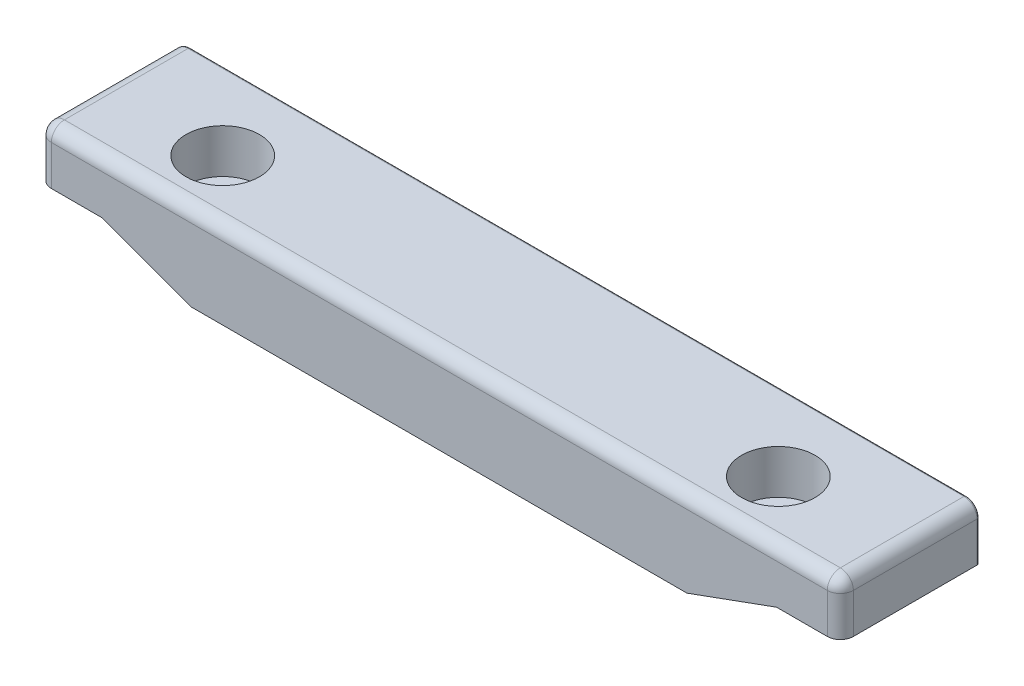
ISO-10303-21;
HEADER;
FILE_DESCRIPTION(('STEP AP214'),'2;1');
FILE_NAME('part.step','',(''),(''),'','','');
FILE_SCHEMA(('AUTOMOTIVE_DESIGN { 1 0 10303 214 1 1 1 1 }'));
ENDSEC;
DATA;
#1=APPLICATION_CONTEXT('core data for automotive mechanical design processes');
#2=APPLICATION_PROTOCOL_DEFINITION('international standard','automotive_design',2000,#1);
#3=PRODUCT_CONTEXT('',#1,'mechanical');
#4=PRODUCT('Part','Part','',(#3));
#5=PRODUCT_RELATED_PRODUCT_CATEGORY('part','',(#4));
#6=PRODUCT_DEFINITION_FORMATION('','',#4);
#7=PRODUCT_DEFINITION_CONTEXT('part definition',#1,'design');
#8=PRODUCT_DEFINITION('design','',#6,#7);
#9=PRODUCT_DEFINITION_SHAPE('','',#8);
#10=(LENGTH_UNIT() NAMED_UNIT(*) SI_UNIT(.MILLI.,.METRE.));
#11=(NAMED_UNIT(*) PLANE_ANGLE_UNIT() SI_UNIT($,.RADIAN.));
#12=(NAMED_UNIT(*) SI_UNIT($,.STERADIAN.) SOLID_ANGLE_UNIT());
#13=UNCERTAINTY_MEASURE_WITH_UNIT(LENGTH_MEASURE(1.E-05),#10,'distance_accuracy_value','');
#14=(GEOMETRIC_REPRESENTATION_CONTEXT(3) GLOBAL_UNCERTAINTY_ASSIGNED_CONTEXT((#13)) GLOBAL_UNIT_ASSIGNED_CONTEXT((#10,
#11,#12)) REPRESENTATION_CONTEXT('',''));
#15=CARTESIAN_POINT('',(0.,0.,0.));
#16=DIRECTION('',(0.,0.,1.));
#17=DIRECTION('',(1.,0.,0.));
#18=AXIS2_PLACEMENT_3D('',#15,#16,#17);
#19=CARTESIAN_POINT('',(-41.3365797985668,22.5093969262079,-17.05));
#20=DIRECTION('',(0.342020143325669,0.939692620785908,0.));
#21=DIRECTION('',(0.,0.,-1.));
#22=AXIS2_PLACEMENT_3D('',#19,#20,#21);
#23=PLANE('',#22);
#24=CARTESIAN_POINT('',(-36.8,20.8582169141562,-7.5));
#25=CARTESIAN_POINT('',(-36.8,20.8582169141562,-13.));
#26=CARTESIAN_POINT('',(-31.2999999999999,18.8563806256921,-13.));
#27=CARTESIAN_POINT('',(-31.3,18.8563806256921,-7.5));
#28=CARTESIAN_POINT('',(-31.2999999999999,18.8563806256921,-2.00000000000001));
#29=CARTESIAN_POINT('',(-36.8,20.8582169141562,-2.00000000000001));
#30=CARTESIAN_POINT('',(-36.8,20.8582169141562,-7.5));
#31=(BOUNDED_CURVE() B_SPLINE_CURVE(3,(#24,#25,#26,#27,#28,#29,#30),.UNSPECIFIED.,.T.,
.F.) B_SPLINE_CURVE_WITH_KNOTS((4,3,4),(0.,3.1415926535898,6.28318530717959),
.UNSPECIFIED.) CURVE() GEOMETRIC_REPRESENTATION_ITEM() RATIONAL_B_SPLINE_CURVE((1.,
0.333333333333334,0.333333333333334,1.,0.333333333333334,0.333333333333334,1.)) REPRESENTATION_ITEM(''));
#32=CARTESIAN_POINT('',(-36.8,20.8582169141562,-7.5));
#33=VERTEX_POINT('',#32);
#34=EDGE_CURVE('E208',#33,#33,#31,.T.);
#35=ORIENTED_EDGE('',*,*,#34,.F.);
#36=EDGE_LOOP('',(#35));
#37=FACE_BOUND('',#36,.T.);
#38=DIRECTION('',(-0.939692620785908,0.342020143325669,0.));
#39=VECTOR('',#38,1.);
#40=CARTESIAN_POINT('',(-41.3365797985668,22.5093969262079,0.));
#41=LINE('',#40,#39);
#42=CARTESIAN_POINT('',(-30.3483270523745,18.51,0.));
#43=VERTEX_POINT('',#42);
#44=CARTESIAN_POINT('',(-41.338236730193,22.51,0.));
#45=VERTEX_POINT('',#44);
#46=EDGE_CURVE('E215',#43,#45,#41,.T.);
#47=ORIENTED_EDGE('',*,*,#46,.T.);
#48=DIRECTION('',(0.,0.,1.));
#49=VECTOR('',#48,1.);
#50=CARTESIAN_POINT('',(-41.338236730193,22.51,-17.05));
#51=LINE('',#50,#49);
#52=CARTESIAN_POINT('',(-41.338236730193,22.51,-17.05));
#53=VERTEX_POINT('',#52);
#54=EDGE_CURVE('E387',#53,#45,#51,.T.);
#55=ORIENTED_EDGE('',*,*,#54,.F.);
#56=DIRECTION('',(-0.939692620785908,0.342020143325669,0.));
#57=VECTOR('',#56,1.);
#58=CARTESIAN_POINT('',(-41.3365797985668,22.5093969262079,-17.05));
#59=LINE('',#58,#57);
#60=CARTESIAN_POINT('',(-30.3483270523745,18.51,-17.05));
#61=VERTEX_POINT('',#60);
#62=EDGE_CURVE('E307',#61,#53,#59,.T.);
#63=ORIENTED_EDGE('',*,*,#62,.F.);
#64=DIRECTION('',(0.,0.,1.));
#65=VECTOR('',#64,1.);
#66=CARTESIAN_POINT('',(-30.3483270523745,18.51,-17.05));
#67=LINE('',#66,#65);
#68=EDGE_CURVE('E11',#61,#43,#67,.T.);
#69=ORIENTED_EDGE('',*,*,#68,.T.);
#70=EDGE_LOOP('',(#47,#55,#63,#69));
#71=FACE_BOUND('',#70,.T.);
#72=ADVANCED_FACE('F16',(#37,#71),#23,.F.);
#73=CARTESIAN_POINT('',(-30.3500903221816,18.51,-17.05));
#74=DIRECTION('',(0.,1.,0.));
#75=DIRECTION('',(1.,0.,0.));
#76=AXIS2_PLACEMENT_3D('',#73,#74,#75);
#77=PLANE('',#76);
#78=DIRECTION('',(-1.,0.,0.));
#79=VECTOR('',#78,1.);
#80=CARTESIAN_POINT('',(-30.3500903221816,18.51,0.));
#81=LINE('',#80,#79);
#82=CARTESIAN_POINT('',(30.3483270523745,18.51,0.));
#83=VERTEX_POINT('',#82);
#84=EDGE_CURVE('E222',#83,#43,#81,.T.);
#85=ORIENTED_EDGE('',*,*,#84,.T.);
#86=ORIENTED_EDGE('',*,*,#68,.F.);
#87=DIRECTION('',(-1.,0.,0.));
#88=VECTOR('',#87,1.);
#89=CARTESIAN_POINT('',(-30.3500903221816,18.51,-17.05));
#90=LINE('',#89,#88);
#91=CARTESIAN_POINT('',(30.3483270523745,18.51,-17.05));
#92=VERTEX_POINT('',#91);
#93=EDGE_CURVE('E238',#92,#61,#90,.T.);
#94=ORIENTED_EDGE('',*,*,#93,.F.);
#95=DIRECTION('',(0.,0.,1.));
#96=VECTOR('',#95,1.);
#97=CARTESIAN_POINT('',(30.3483270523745,18.51,-17.05));
#98=LINE('',#97,#96);
#99=EDGE_CURVE('E19',#92,#83,#98,.T.);
#100=ORIENTED_EDGE('',*,*,#99,.T.);
#101=EDGE_LOOP('',(#85,#86,#94,#100));
#102=FACE_BOUND('',#101,.T.);
#103=ADVANCED_FACE('F399',(#102),#77,.F.);
#104=CARTESIAN_POINT('',(41.3365797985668,22.5093969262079,-17.05));
#105=DIRECTION('',(-0.34202014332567,0.939692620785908,0.));
#106=DIRECTION('',(0.,0.,1.));
#107=AXIS2_PLACEMENT_3D('',#104,#105,#106);
#108=PLANE('',#107);
#109=CARTESIAN_POINT('',(36.8,20.8582169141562,-7.5));
#110=CARTESIAN_POINT('',(36.8,20.8582169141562,-2.00000000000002));
#111=CARTESIAN_POINT('',(31.3,18.8563806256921,-2.00000000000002));
#112=CARTESIAN_POINT('',(31.3,18.8563806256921,-7.5));
#113=CARTESIAN_POINT('',(31.3,18.8563806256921,-13.));
#114=CARTESIAN_POINT('',(36.8,20.8582169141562,-13.));
#115=CARTESIAN_POINT('',(36.8,20.8582169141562,-7.5));
#116=(BOUNDED_CURVE() B_SPLINE_CURVE(3,(#109,#110,#111,#112,#113,#114,#115),.UNSPECIFIED.,.T.,
.F.) B_SPLINE_CURVE_WITH_KNOTS((4,3,4),(0.,3.1415926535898,6.28318530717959),
.UNSPECIFIED.) CURVE() GEOMETRIC_REPRESENTATION_ITEM() RATIONAL_B_SPLINE_CURVE((1.,
0.333333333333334,0.333333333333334,1.,0.333333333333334,0.333333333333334,1.)) REPRESENTATION_ITEM(''));
#117=CARTESIAN_POINT('',(36.8,20.8582169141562,-7.5));
#118=VERTEX_POINT('',#117);
#119=EDGE_CURVE('E228',#118,#118,#116,.T.);
#120=ORIENTED_EDGE('',*,*,#119,.F.);
#121=EDGE_LOOP('',(#120));
#122=FACE_BOUND('',#121,.T.);
#123=DIRECTION('',(-0.939692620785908,-0.34202014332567,0.));
#124=VECTOR('',#123,1.);
#125=CARTESIAN_POINT('',(41.3365797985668,22.5093969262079,0.));
#126=LINE('',#125,#124);
#127=CARTESIAN_POINT('',(41.338236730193,22.51,0.));
#128=VERTEX_POINT('',#127);
#129=EDGE_CURVE('E205',#128,#83,#126,.T.);
#130=ORIENTED_EDGE('',*,*,#129,.T.);
#131=ORIENTED_EDGE('',*,*,#99,.F.);
#132=DIRECTION('',(-0.939692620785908,-0.34202014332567,0.));
#133=VECTOR('',#132,1.);
#134=CARTESIAN_POINT('',(41.3365797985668,22.5093969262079,-17.05));
#135=LINE('',#134,#133);
#136=CARTESIAN_POINT('',(41.338236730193,22.51,-17.05));
#137=VERTEX_POINT('',#136);
#138=EDGE_CURVE('E337',#137,#92,#135,.T.);
#139=ORIENTED_EDGE('',*,*,#138,.F.);
#140=DIRECTION('',(0.,0.,1.));
#141=VECTOR('',#140,1.);
#142=CARTESIAN_POINT('',(41.338236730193,22.51,-17.05));
#143=LINE('',#142,#141);
#144=EDGE_CURVE('E389',#137,#128,#143,.T.);
#145=ORIENTED_EDGE('',*,*,#144,.T.);
#146=EDGE_LOOP('',(#130,#131,#139,#145));
#147=FACE_BOUND('',#146,.T.);
#148=ADVANCED_FACE('F402',(#122,#147),#108,.F.);
#149=CARTESIAN_POINT('',(49.15,22.51,-17.05));
#150=DIRECTION('',(0.,1.,0.));
#151=DIRECTION('',(1.,0.,0.));
#152=AXIS2_PLACEMENT_3D('',#149,#150,#151);
#153=PLANE('',#152);
#154=CARTESIAN_POINT('',(47.55,22.51,-1.6));
#155=DIRECTION('',(0.,-1.,0.));
#156=DIRECTION('',(-1.,0.,0.));
#157=AXIS2_PLACEMENT_3D('',#154,#155,#156);
#158=CIRCLE('',#157,1.6);
#159=CARTESIAN_POINT('',(49.15,22.51,-1.6));
#160=VERTEX_POINT('',#159);
#161=CARTESIAN_POINT('',(47.55,22.51,0.));
#162=VERTEX_POINT('',#161);
#163=EDGE_CURVE('E170',#160,#162,#158,.T.);
#164=ORIENTED_EDGE('',*,*,#163,.T.);
#165=DIRECTION('',(-1.,0.,0.));
#166=VECTOR('',#165,1.);
#167=CARTESIAN_POINT('',(49.15,22.51,0.));
#168=LINE('',#167,#166);
#169=EDGE_CURVE('E199',#162,#128,#168,.T.);
#170=ORIENTED_EDGE('',*,*,#169,.T.);
#171=ORIENTED_EDGE('',*,*,#144,.F.);
#172=DIRECTION('',(-1.,0.,0.));
#173=VECTOR('',#172,1.);
#174=CARTESIAN_POINT('',(49.15,22.51,-17.05));
#175=LINE('',#174,#173);
#176=CARTESIAN_POINT('',(48.85,22.51,-17.05));
#177=VERTEX_POINT('',#176);
#178=EDGE_CURVE('E333',#177,#137,#175,.T.);
#179=ORIENTED_EDGE('',*,*,#178,.F.);
#180=CARTESIAN_POINT('',(48.85,22.51,-16.75));
#181=DIRECTION('',(0.,-1.,0.));
#182=DIRECTION('',(-1.,0.,0.));
#183=AXIS2_PLACEMENT_3D('',#180,#181,#182);
#184=CIRCLE('',#183,0.3);
#185=CARTESIAN_POINT('',(49.15,22.51,-16.75));
#186=VERTEX_POINT('',#185);
#187=EDGE_CURVE('E376',#177,#186,#184,.T.);
#188=ORIENTED_EDGE('',*,*,#187,.T.);
#189=DIRECTION('',(0.,0.,1.));
#190=VECTOR('',#189,1.);
#191=CARTESIAN_POINT('',(49.15,22.51,-17.05));
#192=LINE('',#191,#190);
#193=EDGE_CURVE('E213',#186,#160,#192,.T.);
#194=ORIENTED_EDGE('',*,*,#193,.T.);
#195=EDGE_LOOP('',(#164,#170,#171,#179,#188,#194));
#196=FACE_BOUND('',#195,.T.);
#197=ADVANCED_FACE('F411',(#196),#153,.F.);
#198=CARTESIAN_POINT('',(-49.15,22.51,-17.05));
#199=DIRECTION('',(0.,1.,0.));
#200=DIRECTION('',(1.,0.,0.));
#201=AXIS2_PLACEMENT_3D('',#198,#199,#200);
#202=PLANE('',#201);
#203=CARTESIAN_POINT('',(-47.55,22.51,-1.6));
#204=DIRECTION('',(0.,-1.,0.));
#205=DIRECTION('',(0.,0.,1.));
#206=AXIS2_PLACEMENT_3D('',#203,#204,#205);
#207=CIRCLE('',#206,1.6);
#208=CARTESIAN_POINT('',(-47.55,22.51,0.));
#209=VERTEX_POINT('',#208);
#210=CARTESIAN_POINT('',(-49.15,22.51,-1.6));
#211=VERTEX_POINT('',#210);
#212=EDGE_CURVE('E182',#209,#211,#207,.T.);
#213=ORIENTED_EDGE('',*,*,#212,.T.);
#214=DIRECTION('',(0.,0.,1.));
#215=VECTOR('',#214,1.);
#216=CARTESIAN_POINT('',(-49.15,22.51,-17.05));
#217=LINE('',#216,#215);
#218=CARTESIAN_POINT('',(-49.15,22.51,-16.75));
#219=VERTEX_POINT('',#218);
#220=EDGE_CURVE('E280',#219,#211,#217,.T.);
#221=ORIENTED_EDGE('',*,*,#220,.F.);
#222=CARTESIAN_POINT('',(-48.85,22.51,-16.75));
#223=DIRECTION('',(0.,-1.,0.));
#224=DIRECTION('',(0.,0.,1.));
#225=AXIS2_PLACEMENT_3D('',#222,#223,#224);
#226=CIRCLE('',#225,0.3);
#227=CARTESIAN_POINT('',(-48.85,22.51,-17.05));
#228=VERTEX_POINT('',#227);
#229=EDGE_CURVE('E316',#219,#228,#226,.T.);
#230=ORIENTED_EDGE('',*,*,#229,.T.);
#231=DIRECTION('',(-1.,0.,0.));
#232=VECTOR('',#231,1.);
#233=CARTESIAN_POINT('',(-49.15,22.51,-17.05));
#234=LINE('',#233,#232);
#235=EDGE_CURVE('E311',#53,#228,#234,.T.);
#236=ORIENTED_EDGE('',*,*,#235,.F.);
#237=ORIENTED_EDGE('',*,*,#54,.T.);
#238=DIRECTION('',(-1.,0.,0.));
#239=VECTOR('',#238,1.);
#240=CARTESIAN_POINT('',(-49.15,22.51,0.));
#241=LINE('',#240,#239);
#242=EDGE_CURVE('E223',#45,#209,#241,.T.);
#243=ORIENTED_EDGE('',*,*,#242,.T.);
#244=EDGE_LOOP('',(#213,#221,#230,#236,#237,#243));
#245=FACE_BOUND('',#244,.T.);
#246=ADVANCED_FACE('F464',(#245),#202,.F.);
#247=CARTESIAN_POINT('',(-34.05,29.,-7.5));
#248=DIRECTION('',(0.,1.,0.));
#249=DIRECTION('',(0.,0.,1.));
#250=AXIS2_PLACEMENT_3D('',#247,#248,#249);
#251=CYLINDRICAL_SURFACE('',#250,4.5);
#252=CARTESIAN_POINT('',(-34.05,23.6,-7.5));
#253=DIRECTION('',(0.,1.,0.));
#254=DIRECTION('',(0.,0.,1.));
#255=AXIS2_PLACEMENT_3D('',#252,#253,#254);
#256=CIRCLE('',#255,4.5);
#257=CARTESIAN_POINT('',(-34.05,23.6,-3.));
#258=VERTEX_POINT('',#257);
#259=EDGE_CURVE('E34',#258,#258,#256,.T.);
#260=ORIENTED_EDGE('',*,*,#259,.F.);
#261=EDGE_LOOP('',(#260));
#262=FACE_BOUND('',#261,.T.);
#263=CARTESIAN_POINT('',(-34.05,29.,-7.5));
#264=DIRECTION('',(0.,1.,0.));
#265=DIRECTION('',(0.,0.,1.));
#266=AXIS2_PLACEMENT_3D('',#263,#264,#265);
#267=CIRCLE('',#266,4.5);
#268=CARTESIAN_POINT('',(-34.05,29.,-3.));
#269=VERTEX_POINT('',#268);
#270=EDGE_CURVE('E301',#269,#269,#267,.T.);
#271=ORIENTED_EDGE('',*,*,#270,.T.);
#272=EDGE_LOOP('',(#271));
#273=FACE_BOUND('',#272,.T.);
#274=ADVANCED_FACE('F501',(#262,#273),#251,.F.);
#275=CARTESIAN_POINT('',(-31.3,23.6,-7.5));
#276=DIRECTION('',(0.,-1.,0.));
#277=DIRECTION('',(0.,0.,-1.));
#278=AXIS2_PLACEMENT_3D('',#275,#276,#277);
#279=PLANE('',#278);
#280=CARTESIAN_POINT('',(-34.05,23.6,-7.5));
#281=DIRECTION('',(0.,1.,0.));
#282=DIRECTION('',(0.,0.,1.));
#283=AXIS2_PLACEMENT_3D('',#280,#281,#282);
#284=CIRCLE('',#283,2.75);
#285=CARTESIAN_POINT('',(-34.05,23.6,-4.75));
#286=VERTEX_POINT('',#285);
#287=EDGE_CURVE('E214',#286,#286,#284,.T.);
#288=ORIENTED_EDGE('',*,*,#287,.F.);
#289=EDGE_LOOP('',(#288));
#290=FACE_BOUND('',#289,.T.);
#291=ORIENTED_EDGE('',*,*,#259,.T.);
#292=EDGE_LOOP('',(#291));
#293=FACE_BOUND('',#292,.T.);
#294=ADVANCED_FACE('F512',(#290,#293),#279,.F.);
#295=CARTESIAN_POINT('',(34.05,29.,-7.5));
#296=DIRECTION('',(0.,1.,0.));
#297=DIRECTION('',(0.,0.,1.));
#298=AXIS2_PLACEMENT_3D('',#295,#296,#297);
#299=CYLINDRICAL_SURFACE('',#298,4.5);
#300=CARTESIAN_POINT('',(34.05,23.6,-7.5));
#301=DIRECTION('',(0.,1.,0.));
#302=DIRECTION('',(0.,0.,1.));
#303=AXIS2_PLACEMENT_3D('',#300,#301,#302);
#304=CIRCLE('',#303,4.5);
#305=CARTESIAN_POINT('',(34.05,23.6,-3.));
#306=VERTEX_POINT('',#305);
#307=EDGE_CURVE('E44',#306,#306,#304,.T.);
#308=ORIENTED_EDGE('',*,*,#307,.F.);
#309=EDGE_LOOP('',(#308));
#310=FACE_BOUND('',#309,.T.);
#311=CARTESIAN_POINT('',(34.05,29.,-7.5));
#312=DIRECTION('',(0.,1.,0.));
#313=DIRECTION('',(0.,0.,1.));
#314=AXIS2_PLACEMENT_3D('',#311,#312,#313);
#315=CIRCLE('',#314,4.5);
#316=CARTESIAN_POINT('',(34.05,29.,-3.));
#317=VERTEX_POINT('',#316);
#318=EDGE_CURVE('E304',#317,#317,#315,.T.);
#319=ORIENTED_EDGE('',*,*,#318,.T.);
#320=EDGE_LOOP('',(#319));
#321=FACE_BOUND('',#320,.T.);
#322=ADVANCED_FACE('F522',(#310,#321),#299,.F.);
#323=CARTESIAN_POINT('',(36.8,23.6,-7.5));
#324=DIRECTION('',(0.,-1.,0.));
#325=DIRECTION('',(0.,0.,-1.));
#326=AXIS2_PLACEMENT_3D('',#323,#324,#325);
#327=PLANE('',#326);
#328=CARTESIAN_POINT('',(34.05,23.6,-7.5));
#329=DIRECTION('',(0.,1.,0.));
#330=DIRECTION('',(0.,0.,1.));
#331=AXIS2_PLACEMENT_3D('',#328,#329,#330);
#332=CIRCLE('',#331,2.75);
#333=CARTESIAN_POINT('',(34.05,23.6,-4.75));
#334=VERTEX_POINT('',#333);
#335=EDGE_CURVE('E224',#334,#334,#332,.T.);
#336=ORIENTED_EDGE('',*,*,#335,.F.);
#337=EDGE_LOOP('',(#336));
#338=FACE_BOUND('',#337,.T.);
#339=ORIENTED_EDGE('',*,*,#307,.T.);
#340=EDGE_LOOP('',(#339));
#341=FACE_BOUND('',#340,.T.);
#342=ADVANCED_FACE('F533',(#338,#341),#327,.F.);
#343=CARTESIAN_POINT('',(47.55,27.4,-16.75));
#344=DIRECTION('',(0.,0.,1.));
#345=DIRECTION('',(1.,0.,0.));
#346=AXIS2_PLACEMENT_3D('',#343,#344,#345);
#347=TOROIDAL_SURFACE('',#346,1.3,0.3);
#348=CARTESIAN_POINT('',(47.55,28.7,-16.75));
#349=DIRECTION('',(1.,0.,0.));
#350=DIRECTION('',(0.,0.,-1.));
#351=AXIS2_PLACEMENT_3D('',#348,#349,#350);
#352=CIRCLE('',#351,0.3);
#353=CARTESIAN_POINT('',(47.55,28.7,-17.05));
#354=VERTEX_POINT('',#353);
#355=CARTESIAN_POINT('',(47.55,29.,-16.75));
#356=VERTEX_POINT('',#355);
#357=EDGE_CURVE('E372',#354,#356,#352,.T.);
#358=ORIENTED_EDGE('',*,*,#357,.T.);
#359=CARTESIAN_POINT('',(47.55,27.4,-16.75));
#360=DIRECTION('',(0.,0.,1.));
#361=DIRECTION('',(1.,0.,0.));
#362=AXIS2_PLACEMENT_3D('',#359,#360,#361);
#363=CIRCLE('',#362,1.6);
#364=CARTESIAN_POINT('',(49.15,27.4,-16.75));
#365=VERTEX_POINT('',#364);
#366=EDGE_CURVE('E181',#365,#356,#363,.T.);
#367=ORIENTED_EDGE('',*,*,#366,.F.);
#368=CARTESIAN_POINT('',(48.85,27.4,-16.75));
#369=DIRECTION('',(0.,1.,0.));
#370=DIRECTION('',(0.,0.,1.));
#371=AXIS2_PLACEMENT_3D('',#368,#369,#370);
#372=CIRCLE('',#371,0.3);
#373=CARTESIAN_POINT('',(48.85,27.4,-17.05));
#374=VERTEX_POINT('',#373);
#375=EDGE_CURVE('E380',#365,#374,#372,.T.);
#376=ORIENTED_EDGE('',*,*,#375,.T.);
#377=CARTESIAN_POINT('',(47.55,27.4,-17.05));
#378=DIRECTION('',(0.,0.,-1.));
#379=DIRECTION('',(1.,0.,0.));
#380=AXIS2_PLACEMENT_3D('',#377,#378,#379);
#381=CIRCLE('',#380,1.3);
#382=EDGE_CURVE('E259',#354,#374,#381,.T.);
#383=ORIENTED_EDGE('',*,*,#382,.F.);
#384=EDGE_LOOP('',(#358,#367,#376,#383));
#385=FACE_BOUND('',#384,.T.);
#386=ADVANCED_FACE('F544',(#385),#347,.T.);
#387=CARTESIAN_POINT('',(48.85,29.,-16.75));
#388=DIRECTION('',(0.,-1.,0.));
#389=DIRECTION('',(1.,0.,0.));
#390=AXIS2_PLACEMENT_3D('',#387,#388,#389);
#391=CYLINDRICAL_SURFACE('',#390,0.3);
#392=ORIENTED_EDGE('',*,*,#187,.F.);
#393=DIRECTION('',(0.,-1.,0.));
#394=VECTOR('',#393,1.);
#395=CARTESIAN_POINT('',(48.85,-27.4,-17.05));
#396=LINE('',#395,#394);
#397=EDGE_CURVE('E329',#374,#177,#396,.T.);
#398=ORIENTED_EDGE('',*,*,#397,.F.);
#399=ORIENTED_EDGE('',*,*,#375,.F.);
#400=DIRECTION('',(0.,1.,0.));
#401=VECTOR('',#400,1.);
#402=CARTESIAN_POINT('',(49.15,27.4,-16.75));
#403=LINE('',#402,#401);
#404=EDGE_CURVE('E244',#186,#365,#403,.T.);
#405=ORIENTED_EDGE('',*,*,#404,.F.);
#406=EDGE_LOOP('',(#392,#398,#399,#405));
#407=FACE_BOUND('',#406,.T.);
#408=ADVANCED_FACE('F555',(#407),#391,.T.);
#409=CARTESIAN_POINT('',(-49.15,28.7,-16.75));
#410=DIRECTION('',(1.,0.,0.));
#411=DIRECTION('',(0.,0.,-1.));
#412=AXIS2_PLACEMENT_3D('',#409,#410,#411);
#413=CYLINDRICAL_SURFACE('',#412,0.3);
#414=CARTESIAN_POINT('',(-47.55,28.7,-16.75));
#415=DIRECTION('',(1.,0.,0.));
#416=DIRECTION('',(0.,0.,-1.));
#417=AXIS2_PLACEMENT_3D('',#414,#415,#416);
#418=CIRCLE('',#417,0.3);
#419=CARTESIAN_POINT('',(-47.55,28.7,-17.05));
#420=VERTEX_POINT('',#419);
#421=CARTESIAN_POINT('',(-47.55,29.,-16.75));
#422=VERTEX_POINT('',#421);
#423=EDGE_CURVE('E368',#420,#422,#418,.T.);
#424=ORIENTED_EDGE('',*,*,#423,.T.);
#425=DIRECTION('',(-1.,0.,0.));
#426=VECTOR('',#425,1.);
#427=CARTESIAN_POINT('',(-47.55,29.,-16.75));
#428=LINE('',#427,#426);
#429=EDGE_CURVE('E264',#356,#422,#428,.T.);
#430=ORIENTED_EDGE('',*,*,#429,.F.);
#431=ORIENTED_EDGE('',*,*,#357,.F.);
#432=DIRECTION('',(1.,0.,0.));
#433=VECTOR('',#432,1.);
#434=CARTESIAN_POINT('',(47.55,28.7,-17.05));
#435=LINE('',#434,#433);
#436=EDGE_CURVE('E255',#420,#354,#435,.T.);
#437=ORIENTED_EDGE('',*,*,#436,.F.);
#438=EDGE_LOOP('',(#424,#430,#431,#437));
#439=FACE_BOUND('',#438,.T.);
#440=ADVANCED_FACE('F566',(#439),#413,.T.);
#441=CARTESIAN_POINT('',(-47.55,27.4,-16.75));
#442=DIRECTION('',(0.,0.,1.));
#443=DIRECTION('',(1.,0.,0.));
#444=AXIS2_PLACEMENT_3D('',#441,#442,#443);
#445=TOROIDAL_SURFACE('',#444,1.3,0.3);
#446=CARTESIAN_POINT('',(-48.85,27.4,-16.75));
#447=DIRECTION('',(0.,1.,0.));
#448=DIRECTION('',(0.,0.,1.));
#449=AXIS2_PLACEMENT_3D('',#446,#447,#448);
#450=CIRCLE('',#449,0.3);
#451=CARTESIAN_POINT('',(-48.85,27.4,-17.05));
#452=VERTEX_POINT('',#451);
#453=CARTESIAN_POINT('',(-49.15,27.4,-16.75));
#454=VERTEX_POINT('',#453);
#455=EDGE_CURVE('E319',#452,#454,#450,.T.);
#456=ORIENTED_EDGE('',*,*,#455,.T.);
#457=CARTESIAN_POINT('',(-47.55,27.4,-16.75));
#458=DIRECTION('',(0.,0.,1.));
#459=DIRECTION('',(1.,0.,0.));
#460=AXIS2_PLACEMENT_3D('',#457,#458,#459);
#461=CIRCLE('',#460,1.6);
#462=EDGE_CURVE('E352',#422,#454,#461,.T.);
#463=ORIENTED_EDGE('',*,*,#462,.F.);
#464=ORIENTED_EDGE('',*,*,#423,.F.);
#465=CARTESIAN_POINT('',(-47.55,27.4,-17.05));
#466=DIRECTION('',(0.,0.,-1.));
#467=DIRECTION('',(1.,0.,0.));
#468=AXIS2_PLACEMENT_3D('',#465,#466,#467);
#469=CIRCLE('',#468,1.3);
#470=EDGE_CURVE('E260',#452,#420,#469,.T.);
#471=ORIENTED_EDGE('',*,*,#470,.F.);
#472=EDGE_LOOP('',(#456,#463,#464,#471));
#473=FACE_BOUND('',#472,.T.);
#474=ADVANCED_FACE('F576',(#473),#445,.T.);
#475=CARTESIAN_POINT('',(-48.85,29.,-16.75));
#476=DIRECTION('',(0.,1.,0.));
#477=DIRECTION('',(-1.,0.,0.));
#478=AXIS2_PLACEMENT_3D('',#475,#476,#477);
#479=CYLINDRICAL_SURFACE('',#478,0.3);
#480=ORIENTED_EDGE('',*,*,#229,.F.);
#481=DIRECTION('',(0.,-1.,0.));
#482=VECTOR('',#481,1.);
#483=CARTESIAN_POINT('',(-49.15,-27.4,-16.75));
#484=LINE('',#483,#482);
#485=EDGE_CURVE('E229',#454,#219,#484,.T.);
#486=ORIENTED_EDGE('',*,*,#485,.F.);
#487=ORIENTED_EDGE('',*,*,#455,.F.);
#488=DIRECTION('',(0.,1.,0.));
#489=VECTOR('',#488,1.);
#490=CARTESIAN_POINT('',(-48.85,27.4,-17.05));
#491=LINE('',#490,#489);
#492=EDGE_CURVE('E315',#228,#452,#491,.T.);
#493=ORIENTED_EDGE('',*,*,#492,.F.);
#494=EDGE_LOOP('',(#480,#486,#487,#493));
#495=FACE_BOUND('',#494,.T.);
#496=ADVANCED_FACE('F587',(#495),#479,.T.);
#497=CARTESIAN_POINT('',(47.55,0.,-1.6));
#498=DIRECTION('',(0.,1.,0.));
#499=DIRECTION('',(-1.,0.,0.));
#500=AXIS2_PLACEMENT_3D('',#497,#498,#499);
#501=CYLINDRICAL_SURFACE('',#500,1.6);
#502=ORIENTED_EDGE('',*,*,#163,.F.);
#503=DIRECTION('',(0.,-1.,0.));
#504=VECTOR('',#503,1.);
#505=CARTESIAN_POINT('',(49.15,29.,-1.6));
#506=LINE('',#505,#504);
#507=CARTESIAN_POINT('',(49.15,27.4,-1.6));
#508=VERTEX_POINT('',#507);
#509=EDGE_CURVE('E165',#508,#160,#506,.T.);
#510=ORIENTED_EDGE('',*,*,#509,.F.);
#511=CARTESIAN_POINT('',(47.55,27.4,-1.6));
#512=DIRECTION('',(0.,-1.,0.));
#513=DIRECTION('',(0.,0.,1.));
#514=AXIS2_PLACEMENT_3D('',#511,#512,#513);
#515=CIRCLE('',#514,1.6);
#516=CARTESIAN_POINT('',(47.55,27.4,0.));
#517=VERTEX_POINT('',#516);
#518=EDGE_CURVE('E157',#508,#517,#515,.T.);
#519=ORIENTED_EDGE('',*,*,#518,.T.);
#520=DIRECTION('',(0.,1.,0.));
#521=VECTOR('',#520,1.);
#522=CARTESIAN_POINT('',(47.55,0.,0.));
#523=LINE('',#522,#521);
#524=EDGE_CURVE('E162',#162,#517,#523,.T.);
#525=ORIENTED_EDGE('',*,*,#524,.F.);
#526=EDGE_LOOP('',(#502,#510,#519,#525));
#527=FACE_BOUND('',#526,.T.);
#528=ADVANCED_FACE('F160',(#527),#501,.T.);
#529=CARTESIAN_POINT('',(47.55,27.4,-1.6));
#530=DIRECTION('',(0.,1.,0.));
#531=DIRECTION('',(1.,0.,0.));
#532=AXIS2_PLACEMENT_3D('',#529,#530,#531);
#533=SPHERICAL_SURFACE('',#532,1.6);
#534=CARTESIAN_POINT('',(47.55,27.4,-1.6));
#535=DIRECTION('',(0.,0.,1.));
#536=DIRECTION('',(1.,0.,0.));
#537=AXIS2_PLACEMENT_3D('',#534,#535,#536);
#538=CIRCLE('',#537,1.6);
#539=CARTESIAN_POINT('',(47.55,29.,-1.6));
#540=VERTEX_POINT('',#539);
#541=EDGE_CURVE('E171',#508,#540,#538,.T.);
#542=ORIENTED_EDGE('',*,*,#541,.T.);
#543=CARTESIAN_POINT('',(47.55,27.4,-1.6));
#544=DIRECTION('',(1.,0.,0.));
#545=DIRECTION('',(0.,0.,-1.));
#546=AXIS2_PLACEMENT_3D('',#543,#544,#545);
#547=CIRCLE('',#546,1.6);
#548=EDGE_CURVE('E174',#540,#517,#547,.T.);
#549=ORIENTED_EDGE('',*,*,#548,.T.);
#550=ORIENTED_EDGE('',*,*,#518,.F.);
#551=EDGE_LOOP('',(#542,#549,#550));
#552=FACE_BOUND('',#551,.T.);
#553=ADVANCED_FACE('F176',(#552),#533,.T.);
#554=CARTESIAN_POINT('',(47.55,27.4,-17.05));
#555=DIRECTION('',(0.,0.,1.));
#556=DIRECTION('',(1.,0.,0.));
#557=AXIS2_PLACEMENT_3D('',#554,#555,#556);
#558=CYLINDRICAL_SURFACE('',#557,1.6);
#559=DIRECTION('',(0.,0.,1.));
#560=VECTOR('',#559,1.);
#561=CARTESIAN_POINT('',(49.15,27.4,-17.05));
#562=LINE('',#561,#560);
#563=EDGE_CURVE('E251',#365,#508,#562,.T.);
#564=ORIENTED_EDGE('',*,*,#563,.F.);
#565=ORIENTED_EDGE('',*,*,#366,.T.);
#566=DIRECTION('',(0.,0.,-1.));
#567=VECTOR('',#566,1.);
#568=CARTESIAN_POINT('',(47.55,29.,-17.05));
#569=LINE('',#568,#567);
#570=EDGE_CURVE('E233',#540,#356,#569,.T.);
#571=ORIENTED_EDGE('',*,*,#570,.F.);
#572=ORIENTED_EDGE('',*,*,#541,.F.);
#573=EDGE_LOOP('',(#564,#565,#571,#572));
#574=FACE_BOUND('',#573,.T.);
#575=ADVANCED_FACE('F421',(#574),#558,.T.);
#576=CARTESIAN_POINT('',(0.,27.4,-1.6));
#577=DIRECTION('',(-1.,0.,0.));
#578=DIRECTION('',(0.,0.,1.));
#579=AXIS2_PLACEMENT_3D('',#576,#577,#578);
#580=CYLINDRICAL_SURFACE('',#579,1.6);
#581=CARTESIAN_POINT('',(-47.55,27.4,-1.6));
#582=DIRECTION('',(1.,0.,0.));
#583=DIRECTION('',(0.,0.,1.));
#584=AXIS2_PLACEMENT_3D('',#581,#582,#583);
#585=CIRCLE('',#584,1.6);
#586=CARTESIAN_POINT('',(-47.55,29.,-1.6));
#587=VERTEX_POINT('',#586);
#588=CARTESIAN_POINT('',(-47.55,27.4,0.));
#589=VERTEX_POINT('',#588);
#590=EDGE_CURVE('E188',#587,#589,#585,.T.);
#591=ORIENTED_EDGE('',*,*,#590,.T.);
#592=DIRECTION('',(-1.,0.,0.));
#593=VECTOR('',#592,1.);
#594=CARTESIAN_POINT('',(0.,27.4,0.));
#595=LINE('',#594,#593);
#596=EDGE_CURVE('E186',#517,#589,#595,.T.);
#597=ORIENTED_EDGE('',*,*,#596,.F.);
#598=ORIENTED_EDGE('',*,*,#548,.F.);
#599=DIRECTION('',(1.,0.,0.));
#600=VECTOR('',#599,1.);
#601=CARTESIAN_POINT('',(-49.15,29.,-1.6));
#602=LINE('',#601,#600);
#603=EDGE_CURVE('E277',#587,#540,#602,.T.);
#604=ORIENTED_EDGE('',*,*,#603,.F.);
#605=EDGE_LOOP('',(#591,#597,#598,#604));
#606=FACE_BOUND('',#605,.T.);
#607=ADVANCED_FACE('F187',(#606),#580,.T.);
#608=CARTESIAN_POINT('',(-47.55,0.,-1.6));
#609=DIRECTION('',(0.,-1.,0.));
#610=DIRECTION('',(1.,0.,0.));
#611=AXIS2_PLACEMENT_3D('',#608,#609,#610);
#612=CYLINDRICAL_SURFACE('',#611,1.6);
#613=ORIENTED_EDGE('',*,*,#212,.F.);
#614=DIRECTION('',(0.,-1.,0.));
#615=VECTOR('',#614,1.);
#616=CARTESIAN_POINT('',(-47.55,0.,0.));
#617=LINE('',#616,#615);
#618=EDGE_CURVE('E193',#589,#209,#617,.T.);
#619=ORIENTED_EDGE('',*,*,#618,.F.);
#620=CARTESIAN_POINT('',(-47.55,27.4,-1.6));
#621=DIRECTION('',(0.,-1.,0.));
#622=DIRECTION('',(0.,0.,1.));
#623=AXIS2_PLACEMENT_3D('',#620,#621,#622);
#624=CIRCLE('',#623,1.6);
#625=CARTESIAN_POINT('',(-49.15,27.4,-1.6));
#626=VERTEX_POINT('',#625);
#627=EDGE_CURVE('E273',#589,#626,#624,.T.);
#628=ORIENTED_EDGE('',*,*,#627,.T.);
#629=DIRECTION('',(0.,1.,0.));
#630=VECTOR('',#629,1.);
#631=CARTESIAN_POINT('',(-49.15,29.,-1.6));
#632=LINE('',#631,#630);
#633=EDGE_CURVE('E286',#211,#626,#632,.T.);
#634=ORIENTED_EDGE('',*,*,#633,.F.);
#635=EDGE_LOOP('',(#613,#619,#628,#634));
#636=FACE_BOUND('',#635,.T.);
#637=ADVANCED_FACE('F635',(#636),#612,.T.);
#638=CARTESIAN_POINT('',(-47.55,27.4,-1.6));
#639=DIRECTION('',(0.,1.,0.));
#640=DIRECTION('',(1.,0.,0.));
#641=AXIS2_PLACEMENT_3D('',#638,#639,#640);
#642=SPHERICAL_SURFACE('',#641,1.6);
#643=ORIENTED_EDGE('',*,*,#590,.F.);
#644=CARTESIAN_POINT('',(-47.55,27.4,-1.6));
#645=DIRECTION('',(0.,0.,1.));
#646=DIRECTION('',(1.,0.,0.));
#647=AXIS2_PLACEMENT_3D('',#644,#645,#646);
#648=CIRCLE('',#647,1.6);
#649=EDGE_CURVE('E356',#587,#626,#648,.T.);
#650=ORIENTED_EDGE('',*,*,#649,.T.);
#651=ORIENTED_EDGE('',*,*,#627,.F.);
#652=EDGE_LOOP('',(#643,#650,#651));
#653=FACE_BOUND('',#652,.T.);
#654=ADVANCED_FACE('F645',(#653),#642,.T.);
#655=CARTESIAN_POINT('',(-47.55,27.4,-17.05));
#656=DIRECTION('',(0.,0.,1.));
#657=DIRECTION('',(1.,0.,0.));
#658=AXIS2_PLACEMENT_3D('',#655,#656,#657);
#659=CYLINDRICAL_SURFACE('',#658,1.6);
#660=DIRECTION('',(0.,0.,1.));
#661=VECTOR('',#660,1.);
#662=CARTESIAN_POINT('',(-47.55,29.,-17.05));
#663=LINE('',#662,#661);
#664=EDGE_CURVE('E267',#422,#587,#663,.T.);
#665=ORIENTED_EDGE('',*,*,#664,.F.);
#666=ORIENTED_EDGE('',*,*,#462,.T.);
#667=DIRECTION('',(0.,0.,-1.));
#668=VECTOR('',#667,1.);
#669=CARTESIAN_POINT('',(-49.15,27.4,-17.05));
#670=LINE('',#669,#668);
#671=EDGE_CURVE('E234',#626,#454,#670,.T.);
#672=ORIENTED_EDGE('',*,*,#671,.F.);
#673=ORIENTED_EDGE('',*,*,#649,.F.);
#674=EDGE_LOOP('',(#665,#666,#672,#673));
#675=FACE_BOUND('',#674,.T.);
#676=ADVANCED_FACE('F656',(#675),#659,.T.);
#677=CARTESIAN_POINT('',(0.,0.,0.));
#678=DIRECTION('',(0.,0.,1.));
#679=DIRECTION('',(1.,0.,0.));
#680=AXIS2_PLACEMENT_3D('',#677,#678,#679);
#681=PLANE('',#680);
#682=ORIENTED_EDGE('',*,*,#242,.F.);
#683=ORIENTED_EDGE('',*,*,#46,.F.);
#684=ORIENTED_EDGE('',*,*,#84,.F.);
#685=ORIENTED_EDGE('',*,*,#129,.F.);
#686=ORIENTED_EDGE('',*,*,#169,.F.);
#687=ORIENTED_EDGE('',*,*,#524,.T.);
#688=ORIENTED_EDGE('',*,*,#596,.T.);
#689=ORIENTED_EDGE('',*,*,#618,.T.);
#690=EDGE_LOOP('',(#682,#683,#684,#685,#686,#687,#688,#689));
#691=FACE_BOUND('',#690,.T.);
#692=ADVANCED_FACE('F196',(#691),#681,.T.);
#693=CARTESIAN_POINT('',(0.,0.,-17.05));
#694=DIRECTION('',(0.,0.,1.));
#695=DIRECTION('',(1.,0.,0.));
#696=AXIS2_PLACEMENT_3D('',#693,#694,#695);
#697=PLANE('',#696);
#698=ORIENTED_EDGE('',*,*,#62,.T.);
#699=ORIENTED_EDGE('',*,*,#235,.T.);
#700=ORIENTED_EDGE('',*,*,#492,.T.);
#701=ORIENTED_EDGE('',*,*,#470,.T.);
#702=ORIENTED_EDGE('',*,*,#436,.T.);
#703=ORIENTED_EDGE('',*,*,#382,.T.);
#704=ORIENTED_EDGE('',*,*,#397,.T.);
#705=ORIENTED_EDGE('',*,*,#178,.T.);
#706=ORIENTED_EDGE('',*,*,#138,.T.);
#707=ORIENTED_EDGE('',*,*,#93,.T.);
#708=EDGE_LOOP('',(#698,#699,#700,#701,#702,#703,#704,#705,#706,#707));
#709=FACE_BOUND('',#708,.T.);
#710=ADVANCED_FACE('F407',(#709),#697,.F.);
#711=CARTESIAN_POINT('',(-49.15,29.,-17.05));
#712=DIRECTION('',(0.,1.,0.));
#713=DIRECTION('',(1.,0.,0.));
#714=AXIS2_PLACEMENT_3D('',#711,#712,#713);
#715=PLANE('',#714);
#716=ORIENTED_EDGE('',*,*,#318,.F.);
#717=EDGE_LOOP('',(#716));
#718=FACE_BOUND('',#717,.T.);
#719=ORIENTED_EDGE('',*,*,#270,.F.);
#720=EDGE_LOOP('',(#719));
#721=FACE_BOUND('',#720,.T.);
#722=ORIENTED_EDGE('',*,*,#570,.T.);
#723=ORIENTED_EDGE('',*,*,#429,.T.);
#724=ORIENTED_EDGE('',*,*,#664,.T.);
#725=ORIENTED_EDGE('',*,*,#603,.T.);
#726=EDGE_LOOP('',(#722,#723,#724,#725));
#727=FACE_BOUND('',#726,.T.);
#728=ADVANCED_FACE('F686',(#718,#721,#727),#715,.T.);
#729=CARTESIAN_POINT('',(-49.15,29.,-17.05));
#730=DIRECTION('',(-1.,0.,0.));
#731=DIRECTION('',(0.,1.,0.));
#732=AXIS2_PLACEMENT_3D('',#729,#730,#731);
#733=PLANE('',#732);
#734=ORIENTED_EDGE('',*,*,#220,.T.);
#735=ORIENTED_EDGE('',*,*,#633,.T.);
#736=ORIENTED_EDGE('',*,*,#671,.T.);
#737=ORIENTED_EDGE('',*,*,#485,.T.);
#738=EDGE_LOOP('',(#734,#735,#736,#737));
#739=FACE_BOUND('',#738,.T.);
#740=ADVANCED_FACE('F696',(#739),#733,.T.);
#741=CARTESIAN_POINT('',(49.15,29.,-17.05));
#742=DIRECTION('',(1.,0.,0.));
#743=DIRECTION('',(0.,1.,0.));
#744=AXIS2_PLACEMENT_3D('',#741,#742,#743);
#745=PLANE('',#744);
#746=ORIENTED_EDGE('',*,*,#193,.F.);
#747=ORIENTED_EDGE('',*,*,#404,.T.);
#748=ORIENTED_EDGE('',*,*,#563,.T.);
#749=ORIENTED_EDGE('',*,*,#509,.T.);
#750=EDGE_LOOP('',(#746,#747,#748,#749));
#751=FACE_BOUND('',#750,.T.);
#752=ADVANCED_FACE('F418',(#751),#745,.T.);
#753=CARTESIAN_POINT('',(-34.05,29.,-7.5));
#754=DIRECTION('',(0.,1.,0.));
#755=DIRECTION('',(0.,0.,1.));
#756=AXIS2_PLACEMENT_3D('',#753,#754,#755);
#757=CYLINDRICAL_SURFACE('',#756,2.75);
#758=ORIENTED_EDGE('',*,*,#34,.T.);
#759=EDGE_LOOP('',(#758));
#760=FACE_BOUND('',#759,.T.);
#761=ORIENTED_EDGE('',*,*,#287,.T.);
#762=EDGE_LOOP('',(#761));
#763=FACE_BOUND('',#762,.T.);
#764=ADVANCED_FACE('F717',(#760,#763),#757,.F.);
#765=CARTESIAN_POINT('',(34.05,29.,-7.5));
#766=DIRECTION('',(0.,1.,0.));
#767=DIRECTION('',(0.,0.,1.));
#768=AXIS2_PLACEMENT_3D('',#765,#766,#767);
#769=CYLINDRICAL_SURFACE('',#768,2.75);
#770=ORIENTED_EDGE('',*,*,#119,.T.);
#771=EDGE_LOOP('',(#770));
#772=FACE_BOUND('',#771,.T.);
#773=ORIENTED_EDGE('',*,*,#335,.T.);
#774=EDGE_LOOP('',(#773));
#775=FACE_BOUND('',#774,.T.);
#776=ADVANCED_FACE('F454',(#772,#775),#769,.F.);
#777=CLOSED_SHELL('',(#72,#103,#148,#197,#246,#274,#294,#322,#342,#386,#408,#440,#474,#496,#528,
#553,#575,#607,#637,#654,#676,#692,#710,#728,#740,#752,#764,#776));
#778=MANIFOLD_SOLID_BREP('B1',#777);
#779=ADVANCED_BREP_SHAPE_REPRESENTATION('',(#18,#778),#14);
#780=SHAPE_DEFINITION_REPRESENTATION(#9,#779);
ENDSEC;
END-ISO-10303-21;
